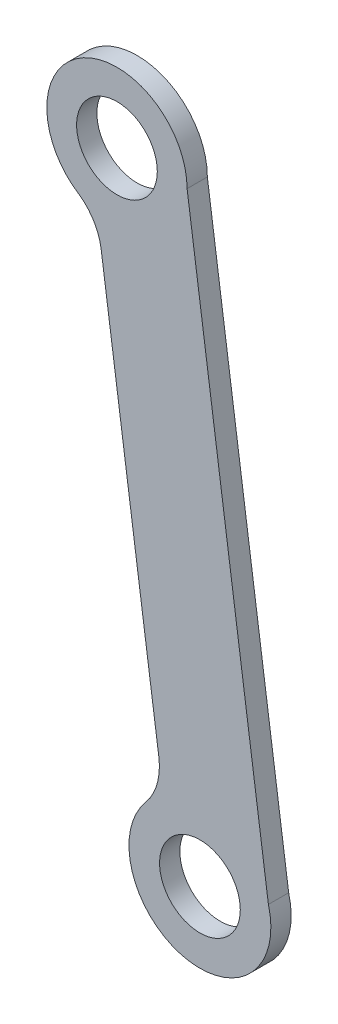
ISO-10303-21;
HEADER;
FILE_DESCRIPTION(('STEP AP214'),'2;1');
FILE_NAME('part.step','',(''),(''),'','','');
FILE_SCHEMA(('AUTOMOTIVE_DESIGN { 1 0 10303 214 1 1 1 1 }'));
ENDSEC;
DATA;
#1=APPLICATION_CONTEXT('core data for automotive mechanical design processes');
#2=APPLICATION_PROTOCOL_DEFINITION('international standard','automotive_design',2000,#1);
#3=PRODUCT_CONTEXT('',#1,'mechanical');
#4=PRODUCT('Part','Part','',(#3));
#5=PRODUCT_RELATED_PRODUCT_CATEGORY('part','',(#4));
#6=PRODUCT_DEFINITION_FORMATION('','',#4);
#7=PRODUCT_DEFINITION_CONTEXT('part definition',#1,'design');
#8=PRODUCT_DEFINITION('design','',#6,#7);
#9=PRODUCT_DEFINITION_SHAPE('','',#8);
#10=(LENGTH_UNIT() NAMED_UNIT(*) SI_UNIT(.MILLI.,.METRE.));
#11=(NAMED_UNIT(*) PLANE_ANGLE_UNIT() SI_UNIT($,.RADIAN.));
#12=(NAMED_UNIT(*) SI_UNIT($,.STERADIAN.) SOLID_ANGLE_UNIT());
#13=UNCERTAINTY_MEASURE_WITH_UNIT(LENGTH_MEASURE(1.E-05),#10,'distance_accuracy_value','');
#14=(GEOMETRIC_REPRESENTATION_CONTEXT(3) GLOBAL_UNCERTAINTY_ASSIGNED_CONTEXT((#13)) GLOBAL_UNIT_ASSIGNED_CONTEXT((#10,
#11,#12)) REPRESENTATION_CONTEXT('',''));
#15=CARTESIAN_POINT('',(0.,0.,0.));
#16=DIRECTION('',(0.,0.,1.));
#17=DIRECTION('',(1.,0.,0.));
#18=AXIS2_PLACEMENT_3D('',#15,#16,#17);
#19=CARTESIAN_POINT('',(343.602360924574,235.174225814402,-2.));
#20=DIRECTION('',(0.,0.,1.));
#21=DIRECTION('',(1.,0.,0.));
#22=AXIS2_PLACEMENT_3D('',#19,#20,#21);
#23=CYLINDRICAL_SURFACE('',#22,5.81601703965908);
#24=CARTESIAN_POINT('',(343.602360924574,235.174225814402,0.));
#25=DIRECTION('',(0.,0.,-1.));
#26=DIRECTION('',(-1.,0.,0.));
#27=AXIS2_PLACEMENT_3D('',#24,#25,#26);
#28=CIRCLE('',#27,5.81601703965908);
#29=CARTESIAN_POINT('',(349.361895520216,235.982814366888,0.));
#30=VERTEX_POINT('',#29);
#31=CARTESIAN_POINT('',(348.053992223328,231.431361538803,0.));
#32=VERTEX_POINT('',#31);
#33=EDGE_CURVE('E84',#30,#32,#28,.T.);
#34=ORIENTED_EDGE('',*,*,#33,.F.);
#35=DIRECTION('',(0.,0.,1.));
#36=VECTOR('',#35,1.);
#37=CARTESIAN_POINT('',(349.361895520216,235.982814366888,-2.));
#38=LINE('',#37,#36);
#39=CARTESIAN_POINT('',(349.361895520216,235.982814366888,-2.));
#40=VERTEX_POINT('',#39);
#41=EDGE_CURVE('E11',#40,#30,#38,.T.);
#42=ORIENTED_EDGE('',*,*,#41,.F.);
#43=CARTESIAN_POINT('',(343.602360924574,235.174225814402,-2.));
#44=DIRECTION('',(0.,0.,-1.));
#45=DIRECTION('',(-1.,0.,0.));
#46=AXIS2_PLACEMENT_3D('',#43,#44,#45);
#47=CIRCLE('',#46,5.81601703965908);
#48=CARTESIAN_POINT('',(348.053992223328,231.431361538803,-2.));
#49=VERTEX_POINT('',#48);
#50=EDGE_CURVE('E86',#40,#49,#47,.T.);
#51=ORIENTED_EDGE('',*,*,#50,.T.);
#52=DIRECTION('',(0.,0.,1.));
#53=VECTOR('',#52,1.);
#54=CARTESIAN_POINT('',(348.053992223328,231.431361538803,-2.));
#55=LINE('',#54,#53);
#56=EDGE_CURVE('E35',#49,#32,#55,.T.);
#57=ORIENTED_EDGE('',*,*,#56,.T.);
#58=EDGE_LOOP('',(#34,#42,#51,#57));
#59=FACE_BOUND('',#58,.T.);
#60=ADVANCED_FACE('F32',(#59),#23,.F.);
#61=CARTESIAN_POINT('',(349.361895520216,235.982814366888,-2.));
#62=DIRECTION('',(-0.990288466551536,-0.139027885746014,0.));
#63=DIRECTION('',(0.139027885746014,-0.990288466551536,0.));
#64=AXIS2_PLACEMENT_3D('',#61,#62,#63);
#65=PLANE('',#64);
#66=DIRECTION('',(0.139027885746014,-0.990288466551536,0.));
#67=VECTOR('',#66,1.);
#68=CARTESIAN_POINT('',(349.361895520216,235.982814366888,0.));
#69=LINE('',#68,#67);
#70=CARTESIAN_POINT('',(343.668341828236,276.53770394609,0.));
#71=VERTEX_POINT('',#70);
#72=EDGE_CURVE('E102',#71,#30,#69,.T.);
#73=ORIENTED_EDGE('',*,*,#72,.F.);
#74=DIRECTION('',(0.,0.,1.));
#75=VECTOR('',#74,1.);
#76=CARTESIAN_POINT('',(343.668341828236,276.53770394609,-2.));
#77=LINE('',#76,#75);
#78=CARTESIAN_POINT('',(343.668341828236,276.53770394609,-2.));
#79=VERTEX_POINT('',#78);
#80=EDGE_CURVE('E40',#79,#71,#77,.T.);
#81=ORIENTED_EDGE('',*,*,#80,.F.);
#82=DIRECTION('',(0.139027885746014,-0.990288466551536,0.));
#83=VECTOR('',#82,1.);
#84=CARTESIAN_POINT('',(349.361895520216,235.982814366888,-2.));
#85=LINE('',#84,#83);
#86=EDGE_CURVE('E91',#79,#40,#85,.T.);
#87=ORIENTED_EDGE('',*,*,#86,.T.);
#88=ORIENTED_EDGE('',*,*,#41,.T.);
#89=EDGE_LOOP('',(#73,#81,#87,#88));
#90=FACE_BOUND('',#89,.T.);
#91=ADVANCED_FACE('F142',(#90),#65,.T.);
#92=CARTESIAN_POINT('',(338.47975601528,275.809271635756,-2.));
#93=DIRECTION('',(0.,0.,1.));
#94=DIRECTION('',(1.,0.,0.));
#95=AXIS2_PLACEMENT_3D('',#92,#93,#94);
#96=CYLINDRICAL_SURFACE('',#95,5.23946909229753);
#97=CARTESIAN_POINT('',(338.47975601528,275.809271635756,0.));
#98=DIRECTION('',(0.,0.,-1.));
#99=DIRECTION('',(1.,0.,0.));
#100=AXIS2_PLACEMENT_3D('',#97,#98,#99);
#101=CIRCLE('',#100,5.23946909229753);
#102=CARTESIAN_POINT('',(341.523822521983,280.073740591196,0.));
#103=VERTEX_POINT('',#102);
#104=EDGE_CURVE('E114',#103,#71,#101,.T.);
#105=ORIENTED_EDGE('',*,*,#104,.F.);
#106=DIRECTION('',(0.,0.,1.));
#107=VECTOR('',#106,1.);
#108=CARTESIAN_POINT('',(341.523822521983,280.073740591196,-2.));
#109=LINE('',#108,#107);
#110=CARTESIAN_POINT('',(341.523822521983,280.073740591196,-2.));
#111=VERTEX_POINT('',#110);
#112=EDGE_CURVE('E130',#111,#103,#109,.T.);
#113=ORIENTED_EDGE('',*,*,#112,.F.);
#114=CARTESIAN_POINT('',(338.47975601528,275.809271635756,-2.));
#115=DIRECTION('',(0.,0.,-1.));
#116=DIRECTION('',(1.,0.,0.));
#117=AXIS2_PLACEMENT_3D('',#114,#115,#116);
#118=CIRCLE('',#117,5.23946909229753);
#119=EDGE_CURVE('E126',#111,#79,#118,.T.);
#120=ORIENTED_EDGE('',*,*,#119,.T.);
#121=ORIENTED_EDGE('',*,*,#80,.T.);
#122=EDGE_LOOP('',(#105,#113,#120,#121));
#123=FACE_BOUND('',#122,.T.);
#124=ADVANCED_FACE('F147',(#123),#96,.F.);
#125=CARTESIAN_POINT('',(345.231481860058,285.91654413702,-2.));
#126=DIRECTION('',(0.,0.,1.));
#127=DIRECTION('',(1.,0.,0.));
#128=AXIS2_PLACEMENT_3D('',#125,#126,#127);
#129=CYLINDRICAL_SURFACE('',#128,6.91990542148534);
#130=CARTESIAN_POINT('',(345.231481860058,285.91654413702,0.));
#131=DIRECTION('',(0.,0.,1.));
#132=DIRECTION('',(1.,0.,0.));
#133=AXIS2_PLACEMENT_3D('',#130,#131,#132);
#134=CIRCLE('',#133,6.91990542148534);
#135=CARTESIAN_POINT('',(352.151387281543,285.91654413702,0.));
#136=VERTEX_POINT('',#135);
#137=EDGE_CURVE('E111',#136,#103,#134,.T.);
#138=ORIENTED_EDGE('',*,*,#137,.F.);
#139=DIRECTION('',(0.,0.,1.));
#140=VECTOR('',#139,1.);
#141=CARTESIAN_POINT('',(352.151387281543,285.91654413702,-2.));
#142=LINE('',#141,#140);
#143=CARTESIAN_POINT('',(352.151387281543,285.91654413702,-2.));
#144=VERTEX_POINT('',#143);
#145=EDGE_CURVE('E132',#144,#136,#142,.T.);
#146=ORIENTED_EDGE('',*,*,#145,.F.);
#147=CARTESIAN_POINT('',(345.231481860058,285.91654413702,-2.));
#148=DIRECTION('',(0.,0.,1.));
#149=DIRECTION('',(1.,0.,0.));
#150=AXIS2_PLACEMENT_3D('',#147,#148,#149);
#151=CIRCLE('',#150,6.91990542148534);
#152=EDGE_CURVE('E123',#144,#111,#151,.T.);
#153=ORIENTED_EDGE('',*,*,#152,.T.);
#154=ORIENTED_EDGE('',*,*,#112,.T.);
#155=EDGE_LOOP('',(#138,#146,#153,#154));
#156=FACE_BOUND('',#155,.T.);
#157=ADVANCED_FACE('F139',(#156),#129,.T.);
#158=CARTESIAN_POINT('',(352.151387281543,285.91654413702,-2.));
#159=DIRECTION('',(0.990288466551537,0.139027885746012,0.));
#160=DIRECTION('',(-0.139027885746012,0.990288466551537,0.));
#161=AXIS2_PLACEMENT_3D('',#158,#159,#160);
#162=PLANE('',#161);
#163=DIRECTION('',(-0.139027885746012,0.990288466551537,0.));
#164=VECTOR('',#163,1.);
#165=CARTESIAN_POINT('',(352.151387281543,285.91654413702,0.));
#166=LINE('',#165,#164);
#167=CARTESIAN_POINT('',(360.174738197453,228.766628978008,0.));
#168=VERTEX_POINT('',#167);
#169=EDGE_CURVE('E98',#168,#136,#166,.T.);
#170=ORIENTED_EDGE('',*,*,#169,.F.);
#171=DIRECTION('',(0.,0.,1.));
#172=VECTOR('',#171,1.);
#173=CARTESIAN_POINT('',(360.174738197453,228.766628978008,-2.));
#174=LINE('',#173,#172);
#175=CARTESIAN_POINT('',(360.174738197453,228.766628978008,-2.));
#176=VERTEX_POINT('',#175);
#177=EDGE_CURVE('E90',#176,#168,#174,.T.);
#178=ORIENTED_EDGE('',*,*,#177,.F.);
#179=DIRECTION('',(-0.139027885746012,0.990288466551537,0.));
#180=VECTOR('',#179,1.);
#181=CARTESIAN_POINT('',(352.151387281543,285.91654413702,-2.));
#182=LINE('',#181,#180);
#183=EDGE_CURVE('E120',#176,#144,#182,.T.);
#184=ORIENTED_EDGE('',*,*,#183,.T.);
#185=ORIENTED_EDGE('',*,*,#145,.T.);
#186=EDGE_LOOP('',(#170,#178,#184,#185));
#187=FACE_BOUND('',#186,.T.);
#188=ADVANCED_FACE('F135',(#187),#162,.T.);
#189=CARTESIAN_POINT('',(353.418094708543,226.931954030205,-2.));
#190=DIRECTION('',(0.,0.,1.));
#191=DIRECTION('',(1.,0.,0.));
#192=AXIS2_PLACEMENT_3D('',#189,#190,#191);
#193=CYLINDRICAL_SURFACE('',#192,7.00130440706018);
#194=CARTESIAN_POINT('',(353.418094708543,226.931954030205,0.));
#195=DIRECTION('',(0.,0.,1.));
#196=DIRECTION('',(1.,0.,0.));
#197=AXIS2_PLACEMENT_3D('',#194,#195,#196);
#198=CIRCLE('',#197,7.00130440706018);
#199=EDGE_CURVE('E93',#32,#168,#198,.T.);
#200=ORIENTED_EDGE('',*,*,#199,.F.);
#201=ORIENTED_EDGE('',*,*,#56,.F.);
#202=CARTESIAN_POINT('',(353.418094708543,226.931954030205,-2.));
#203=DIRECTION('',(0.,0.,1.));
#204=DIRECTION('',(1.,0.,0.));
#205=AXIS2_PLACEMENT_3D('',#202,#203,#204);
#206=CIRCLE('',#205,7.00130440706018);
#207=EDGE_CURVE('E118',#49,#176,#206,.T.);
#208=ORIENTED_EDGE('',*,*,#207,.T.);
#209=ORIENTED_EDGE('',*,*,#177,.T.);
#210=EDGE_LOOP('',(#200,#201,#208,#209));
#211=FACE_BOUND('',#210,.T.);
#212=ADVANCED_FACE('F94',(#211),#193,.T.);
#213=CARTESIAN_POINT('',(343.602360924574,235.174225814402,-2.));
#214=DIRECTION('',(0.,0.,-1.));
#215=DIRECTION('',(-1.,0.,0.));
#216=AXIS2_PLACEMENT_3D('',#213,#214,#215);
#217=PLANE('',#216);
#218=CARTESIAN_POINT('',(345.231481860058,285.91654413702,-2.));
#219=DIRECTION('',(0.,0.,1.));
#220=DIRECTION('',(1.,0.,0.));
#221=AXIS2_PLACEMENT_3D('',#218,#219,#220);
#222=CIRCLE('',#221,3.98165201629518);
#223=CARTESIAN_POINT('',(349.213133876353,285.91654413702,-2.));
#224=VERTEX_POINT('',#223);
#225=EDGE_CURVE('E233',#224,#224,#222,.T.);
#226=ORIENTED_EDGE('',*,*,#225,.T.);
#227=EDGE_LOOP('',(#226));
#228=FACE_BOUND('',#227,.T.);
#229=CARTESIAN_POINT('',(353.418094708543,226.931954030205,-2.));
#230=DIRECTION('',(0.,0.,1.));
#231=DIRECTION('',(1.,0.,0.));
#232=AXIS2_PLACEMENT_3D('',#229,#230,#231);
#233=CIRCLE('',#232,3.98165201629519);
#234=CARTESIAN_POINT('',(357.399746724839,226.931954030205,-2.));
#235=VERTEX_POINT('',#234);
#236=EDGE_CURVE('E103',#235,#235,#233,.T.);
#237=ORIENTED_EDGE('',*,*,#236,.T.);
#238=EDGE_LOOP('',(#237));
#239=FACE_BOUND('',#238,.T.);
#240=ORIENTED_EDGE('',*,*,#50,.F.);
#241=ORIENTED_EDGE('',*,*,#86,.F.);
#242=ORIENTED_EDGE('',*,*,#119,.F.);
#243=ORIENTED_EDGE('',*,*,#152,.F.);
#244=ORIENTED_EDGE('',*,*,#183,.F.);
#245=ORIENTED_EDGE('',*,*,#207,.F.);
#246=EDGE_LOOP('',(#240,#241,#242,#243,#244,#245));
#247=FACE_BOUND('',#246,.T.);
#248=ADVANCED_FACE('F146',(#228,#239,#247),#217,.T.);
#249=CARTESIAN_POINT('',(343.602360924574,235.174225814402,0.));
#250=DIRECTION('',(0.,0.,-1.));
#251=DIRECTION('',(-1.,0.,0.));
#252=AXIS2_PLACEMENT_3D('',#249,#250,#251);
#253=PLANE('',#252);
#254=CARTESIAN_POINT('',(345.231481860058,285.91654413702,0.));
#255=DIRECTION('',(0.,0.,1.));
#256=DIRECTION('',(1.,0.,0.));
#257=AXIS2_PLACEMENT_3D('',#254,#255,#256);
#258=CIRCLE('',#257,3.98165201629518);
#259=CARTESIAN_POINT('',(349.213133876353,285.91654413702,0.));
#260=VERTEX_POINT('',#259);
#261=EDGE_CURVE('E236',#260,#260,#258,.T.);
#262=ORIENTED_EDGE('',*,*,#261,.F.);
#263=EDGE_LOOP('',(#262));
#264=FACE_BOUND('',#263,.T.);
#265=CARTESIAN_POINT('',(353.418094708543,226.931954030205,0.));
#266=DIRECTION('',(0.,0.,1.));
#267=DIRECTION('',(1.,0.,0.));
#268=AXIS2_PLACEMENT_3D('',#265,#266,#267);
#269=CIRCLE('',#268,3.98165201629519);
#270=CARTESIAN_POINT('',(357.399746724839,226.931954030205,0.));
#271=VERTEX_POINT('',#270);
#272=EDGE_CURVE('E106',#271,#271,#269,.T.);
#273=ORIENTED_EDGE('',*,*,#272,.F.);
#274=EDGE_LOOP('',(#273));
#275=FACE_BOUND('',#274,.T.);
#276=ORIENTED_EDGE('',*,*,#33,.T.);
#277=ORIENTED_EDGE('',*,*,#199,.T.);
#278=ORIENTED_EDGE('',*,*,#169,.T.);
#279=ORIENTED_EDGE('',*,*,#137,.T.);
#280=ORIENTED_EDGE('',*,*,#104,.T.);
#281=ORIENTED_EDGE('',*,*,#72,.T.);
#282=EDGE_LOOP('',(#276,#277,#278,#279,#280,#281));
#283=FACE_BOUND('',#282,.T.);
#284=ADVANCED_FACE('F100',(#264,#275,#283),#253,.F.);
#285=CARTESIAN_POINT('',(353.418094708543,226.931954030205,-2.));
#286=DIRECTION('',(0.,0.,1.));
#287=DIRECTION('',(1.,0.,0.));
#288=AXIS2_PLACEMENT_3D('',#285,#286,#287);
#289=CYLINDRICAL_SURFACE('',#288,3.98165201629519);
#290=ORIENTED_EDGE('',*,*,#236,.F.);
#291=EDGE_LOOP('',(#290));
#292=FACE_BOUND('',#291,.T.);
#293=ORIENTED_EDGE('',*,*,#272,.T.);
#294=EDGE_LOOP('',(#293));
#295=FACE_BOUND('',#294,.T.);
#296=ADVANCED_FACE('F206',(#292,#295),#289,.F.);
#297=CARTESIAN_POINT('',(345.231481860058,285.91654413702,-2.));
#298=DIRECTION('',(0.,0.,1.));
#299=DIRECTION('',(1.,0.,0.));
#300=AXIS2_PLACEMENT_3D('',#297,#298,#299);
#301=CYLINDRICAL_SURFACE('',#300,3.98165201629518);
#302=ORIENTED_EDGE('',*,*,#225,.F.);
#303=EDGE_LOOP('',(#302));
#304=FACE_BOUND('',#303,.T.);
#305=ORIENTED_EDGE('',*,*,#261,.T.);
#306=EDGE_LOOP('',(#305));
#307=FACE_BOUND('',#306,.T.);
#308=ADVANCED_FACE('F216',(#304,#307),#301,.F.);
#309=CLOSED_SHELL('',(#60,#91,#124,#157,#188,#212,#248,#284,#296,#308));
#310=MANIFOLD_SOLID_BREP('B2',#309);
#311=ADVANCED_BREP_SHAPE_REPRESENTATION('',(#18,#310),#14);
#312=SHAPE_DEFINITION_REPRESENTATION(#9,#311);
ENDSEC;
END-ISO-10303-21;
